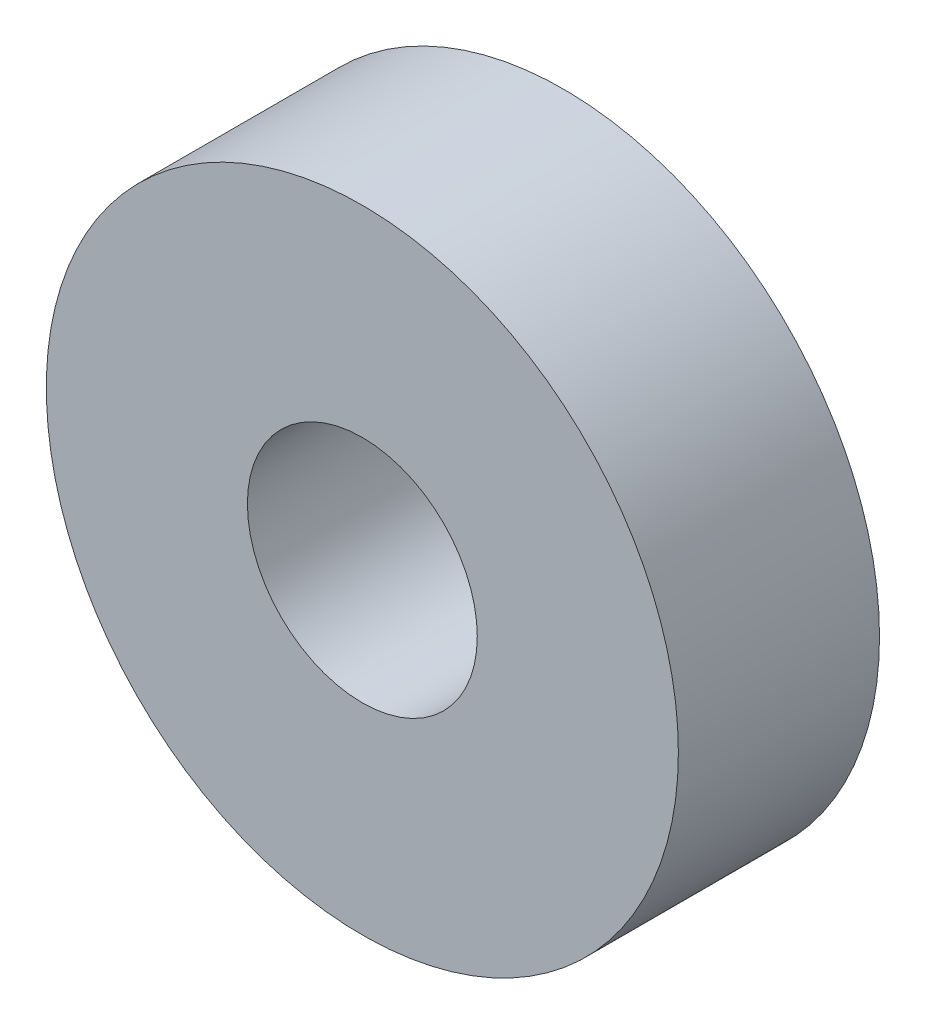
ISO-10303-21;
HEADER;
FILE_DESCRIPTION(('STEP AP214'),'2;1');
FILE_NAME('part.step','',(''),(''),'','','');
FILE_SCHEMA(('AUTOMOTIVE_DESIGN { 1 0 10303 214 1 1 1 1 }'));
ENDSEC;
DATA;
#1=APPLICATION_CONTEXT('core data for automotive mechanical design processes');
#2=APPLICATION_PROTOCOL_DEFINITION('international standard','automotive_design',2000,#1);
#3=PRODUCT_CONTEXT('',#1,'mechanical');
#4=PRODUCT('Part','Part','',(#3));
#5=PRODUCT_RELATED_PRODUCT_CATEGORY('part','',(#4));
#6=PRODUCT_DEFINITION_FORMATION('','',#4);
#7=PRODUCT_DEFINITION_CONTEXT('part definition',#1,'design');
#8=PRODUCT_DEFINITION('design','',#6,#7);
#9=PRODUCT_DEFINITION_SHAPE('','',#8);
#10=(LENGTH_UNIT() NAMED_UNIT(*) SI_UNIT(.MILLI.,.METRE.));
#11=(NAMED_UNIT(*) PLANE_ANGLE_UNIT() SI_UNIT($,.RADIAN.));
#12=(NAMED_UNIT(*) SI_UNIT($,.STERADIAN.) SOLID_ANGLE_UNIT());
#13=UNCERTAINTY_MEASURE_WITH_UNIT(LENGTH_MEASURE(1.E-05),#10,'distance_accuracy_value','');
#14=(GEOMETRIC_REPRESENTATION_CONTEXT(3) GLOBAL_UNCERTAINTY_ASSIGNED_CONTEXT((#13)) GLOBAL_UNIT_ASSIGNED_CONTEXT((#10,
#11,#12)) REPRESENTATION_CONTEXT('',''));
#15=CARTESIAN_POINT('',(0.,0.,0.));
#16=DIRECTION('',(0.,0.,1.));
#17=DIRECTION('',(1.,0.,0.));
#18=AXIS2_PLACEMENT_3D('',#15,#16,#17);
#19=CARTESIAN_POINT('',(0.,0.,7.00024));
#20=DIRECTION('',(0.,0.,1.));
#21=DIRECTION('',(1.,0.,0.));
#22=AXIS2_PLACEMENT_3D('',#19,#20,#21);
#23=PLANE('',#22);
#24=CARTESIAN_POINT('',(0.,0.,7.00024));
#25=DIRECTION('',(0.,0.,1.));
#26=DIRECTION('',(1.,0.,0.));
#27=AXIS2_PLACEMENT_3D('',#24,#25,#26);
#28=CIRCLE('',#27,10.99947);
#29=CARTESIAN_POINT('',(10.99947,0.,7.00024));
#30=VERTEX_POINT('',#29);
#31=EDGE_CURVE('E10',#30,#30,#28,.T.);
#32=ORIENTED_EDGE('',*,*,#31,.T.);
#33=EDGE_LOOP('',(#32));
#34=FACE_BOUND('',#33,.T.);
#35=CARTESIAN_POINT('',(0.,0.,7.00024));
#36=DIRECTION('',(0.,0.,1.));
#37=DIRECTION('',(1.,0.,0.));
#38=AXIS2_PLACEMENT_3D('',#35,#36,#37);
#39=CIRCLE('',#38,4.0005);
#40=CARTESIAN_POINT('',(4.0005,0.,7.00024));
#41=VERTEX_POINT('',#40);
#42=EDGE_CURVE('E39',#41,#41,#39,.T.);
#43=ORIENTED_EDGE('',*,*,#42,.F.);
#44=EDGE_LOOP('',(#43));
#45=FACE_BOUND('',#44,.T.);
#46=ADVANCED_FACE('F28',(#34,#45),#23,.T.);
#47=CARTESIAN_POINT('',(0.,0.,0.));
#48=DIRECTION('',(0.,0.,1.));
#49=DIRECTION('',(1.,0.,0.));
#50=AXIS2_PLACEMENT_3D('',#47,#48,#49);
#51=PLANE('',#50);
#52=CARTESIAN_POINT('',(0.,0.,0.));
#53=DIRECTION('',(0.,0.,1.));
#54=DIRECTION('',(1.,0.,0.));
#55=AXIS2_PLACEMENT_3D('',#52,#53,#54);
#56=CIRCLE('',#55,10.99947);
#57=CARTESIAN_POINT('',(10.99947,0.,0.));
#58=VERTEX_POINT('',#57);
#59=EDGE_CURVE('E35',#58,#58,#56,.T.);
#60=ORIENTED_EDGE('',*,*,#59,.F.);
#61=EDGE_LOOP('',(#60));
#62=FACE_BOUND('',#61,.T.);
#63=CARTESIAN_POINT('',(0.,0.,0.));
#64=DIRECTION('',(0.,0.,1.));
#65=DIRECTION('',(1.,0.,0.));
#66=AXIS2_PLACEMENT_3D('',#63,#64,#65);
#67=CIRCLE('',#66,4.0005);
#68=CARTESIAN_POINT('',(4.0005,0.,0.));
#69=VERTEX_POINT('',#68);
#70=EDGE_CURVE('E43',#69,#69,#67,.T.);
#71=ORIENTED_EDGE('',*,*,#70,.T.);
#72=EDGE_LOOP('',(#71));
#73=FACE_BOUND('',#72,.T.);
#74=ADVANCED_FACE('F49',(#62,#73),#51,.F.);
#75=CARTESIAN_POINT('',(0.,0.,7.00024));
#76=DIRECTION('',(0.,0.,-1.));
#77=DIRECTION('',(-1.,0.,0.));
#78=AXIS2_PLACEMENT_3D('',#75,#76,#77);
#79=CYLINDRICAL_SURFACE('',#78,10.99947);
#80=ORIENTED_EDGE('',*,*,#31,.F.);
#81=EDGE_LOOP('',(#80));
#82=FACE_BOUND('',#81,.T.);
#83=ORIENTED_EDGE('',*,*,#59,.T.);
#84=EDGE_LOOP('',(#83));
#85=FACE_BOUND('',#84,.T.);
#86=ADVANCED_FACE('F30',(#82,#85),#79,.T.);
#87=CARTESIAN_POINT('',(0.,0.,7.00024));
#88=DIRECTION('',(0.,0.,-1.));
#89=DIRECTION('',(-1.,0.,0.));
#90=AXIS2_PLACEMENT_3D('',#87,#88,#89);
#91=CYLINDRICAL_SURFACE('',#90,4.0005);
#92=ORIENTED_EDGE('',*,*,#42,.T.);
#93=EDGE_LOOP('',(#92));
#94=FACE_BOUND('',#93,.T.);
#95=ORIENTED_EDGE('',*,*,#70,.F.);
#96=EDGE_LOOP('',(#95));
#97=FACE_BOUND('',#96,.T.);
#98=ADVANCED_FACE('F51',(#94,#97),#91,.F.);
#99=CLOSED_SHELL('',(#46,#74,#86,#98));
#100=MANIFOLD_SOLID_BREP('B2',#99);
#101=ADVANCED_BREP_SHAPE_REPRESENTATION('',(#18,#100),#14);
#102=SHAPE_DEFINITION_REPRESENTATION(#9,#101);
ENDSEC;
END-ISO-10303-21;
